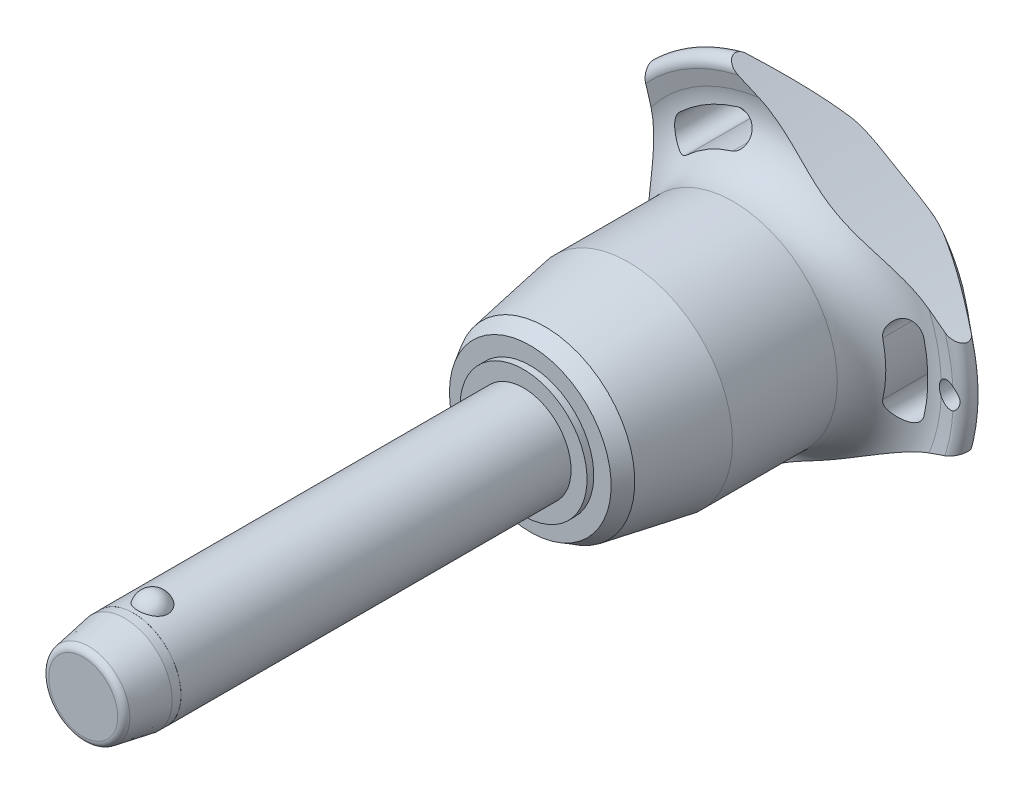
from build123d import *

# Parameters (mm, degrees)
SKETCH1_R           = 6
BOSS_EXTRUDE1_DEPTH = 45
SKETCH2_R           = 5.15
BOSS_EXTRUDE2_DEPTH = 39.7
BOSS_EXTRUDE3_START = 10.6
SKETCH1_2_R         = 6
BOSS_EXTRUDE3_DEPTH = 10.6
CHAMFER1_SIZE       = 5.3
CHAMFER1_SIZE2      = 0.934532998
FILLET1_R           = 0.85
SKETCH6_R           = 144.275
CUT_EXTRUDE1_DEPTH  = 92.145351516
CIRPATTERN1_COUNT   = 3
SKETCH7_R           = 1.5
CUT_EXTRUDE2_DEPTH  = 91.924898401
SKETCH8_R           = 6
SKETCH8_R_2         = 5.99
CUT_EXTRUDE3_DEPTH  = 6.36


with BuildPart() as part:
    # Sketch1 → Boss-Extrude1 (new body)
    with BuildSketch(Plane.XY):
        Circle(SKETCH1_R)
    extrude(amount=-BOSS_EXTRUDE1_DEPTH)

    # Sketch2 → Boss-Extrude2 (add)
    with BuildSketch(Plane(origin=(0, 0, -45), x_dir=(-1, 0, 0), z_dir=(0, 0, -1))):
        Circle(SKETCH2_R)
    extrude(amount=BOSS_EXTRUDE2_DEPTH)

    # Sketch3 → Revolve1 (revolve)
    with BuildSketch(Plane(origin=(0, 0, 0), x_dir=(0, 0, -1), z_dir=(1, 0, 0))):
        with BuildLine():
            Line((-1.854049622, 7.25), (-1.854049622, 3.25))
            ThreePointArc((-1.854049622, 3.25), (0.145950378, 5.25), (-1.854049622, 7.25))
        make_face()
        with BuildLine():
            Line((-1.854049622, -3.25), (-1.854049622, -7.25))
            ThreePointArc((-1.854049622, -7.25), (0.145950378, -5.25), (-1.854049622, -3.25))
        make_face()
    revolve(axis=Axis((0, -3.25, 1.854049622), (0, 1, 0)))

    # Sketch1_2 → Boss-Extrude3 (add)
    with BuildSketch(Plane.XY.offset(BOSS_EXTRUDE3_START)):
        Circle(SKETCH1_2_R)
    extrude(amount=-BOSS_EXTRUDE3_DEPTH)

    # Chamfer1
    chamfer1_edges = [part.edges().sort_by_distance(p)[0] for p in [
        (-6, 0, 10.6),
    ]]
    chamfer1_side = [part.faces().sort_by_distance(p)[0] for p in [
        (-6, 0, -17.2),
    ]]
    chamfer(chamfer1_edges, length=CHAMFER1_SIZE, length2=CHAMFER1_SIZE2, reference=chamfer1_side[0])

    # Fillet1
    fillet1_edges = [part.edges().sort_by_distance(p)[0] for p in [
        (-5.065467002, 0, 10.6),
        (5.15, 0, -84.7),
    ]]
    fillet(fillet1_edges, radius=FILLET1_R)

    # Sketch4 → Revolve2 (revolve)
    with BuildSketch(Plane(origin=(0, 0, 0), x_dir=(0, 0, -1), z_dir=(1, 0, 0)), mode=Mode.PRIVATE) as revolve2_sk:
        Polygon((45, 0), (45, 8.017240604), (45.85, 8.017240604), (45.85, 10.206249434), (47.745737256, 11.300753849), (58.233333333, 13.15), (71.466666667, 13.15), (71.466666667, 0), align=None)
    revolve(revolve2_sk.sketch.rotate(Axis((0, 0, -71.466666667), (0, 0, 1)), 90), axis=Axis((0, 0, -71.466666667), (0, 0, 1)))

    # Sketch5 → Revolve3 (revolve)
    with BuildSketch(Plane(origin=(0, 0, 0), x_dir=(0, 0, -1), z_dir=(1, 0, 0)), mode=Mode.PRIVATE) as revolve3_sk:
        with BuildLine():
            Line((77.32877039, 20.428960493), (76.910912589, 22.344207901))
            ThreePointArc((76.910912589, 22.344207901), (77.554394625, 23.677136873), (79.002586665, 23.371345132))
            Line((79.002586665, 23.371345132), (84.141488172, 17.247040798))
            ThreePointArc((84.141488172, 17.247040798), (84.7, 15.584758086), (83.978803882, 13.986322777))
            ThreePointArc((83.978803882, 13.986322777), (79.617427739, 7.589034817), (78.083333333, 0))
            Line((78.083333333, 0), (71.466666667, 0))
            Line((71.466666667, 0), (71.466666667, 13.15))
            ThreePointArc((71.466666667, 13.15), (76.139661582, 15.38660811), (77.32877039, 20.428960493))
        make_face()
    revolve(revolve3_sk.sketch.rotate(Axis((0, 0, -78.083333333), (0, 0, 1)), 90), axis=Axis((0, 0, -78.083333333), (0, 0, 1)))

    # Sketch6 → Cut-Extrude1 (cut, through all)
    with BuildSketch(Plane.XY):
        with Locations((-159.975, 0)):
            Circle(SKETCH6_R)
        with BuildLine():
            ThreePointArc((18.131206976, -4.190753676), (18.60922037, 0), (18.131206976, 4.190753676))
            ThreePointArc((18.131206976, 4.190753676), (15.94840906, 5.553949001), (14.585213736, 3.371151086))
            ThreePointArc((14.585213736, 3.371151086), (14.969740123, 0), (14.585213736, -3.371151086))
            ThreePointArc((14.585213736, -3.371151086), (15.94840906, -5.553949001), (18.131206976, -4.190753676))
        make_face()
    cut_extrude1 = extrude(amount=-CUT_EXTRUDE1_DEPTH, mode=Mode.SUBTRACT)

    # CirPattern1: Cut-Extrude1 ×3 about axis
    cirpattern1_axis = Axis((0, 0, 0), (0, 0, 1))
    for i in range(1, CIRPATTERN1_COUNT):
        add(cut_extrude1.rotate(cirpattern1_axis, i * 360 / CIRPATTERN1_COUNT), mode=Mode.SUBTRACT)

    # Sketch7 → Cut-Extrude2 (cut, through all)
    with BuildSketch(Plane.XY):
        with Locations(Location((21.60922037, 0, 0), (0, 0, 297.620773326))):
            Circle(SKETCH7_R)
    extrude(amount=-CUT_EXTRUDE2_DEPTH, mode=Mode.SUBTRACT)

    # Sketch8 → Cut-Extrude3 (cut)
    with BuildSketch(Plane.XY.offset(10.6)):
        Circle(SKETCH8_R)
        Circle(SKETCH8_R_2, mode=Mode.SUBTRACT)
    extrude(amount=-CUT_EXTRUDE3_DEPTH, mode=Mode.SUBTRACT)


solid = part.part
